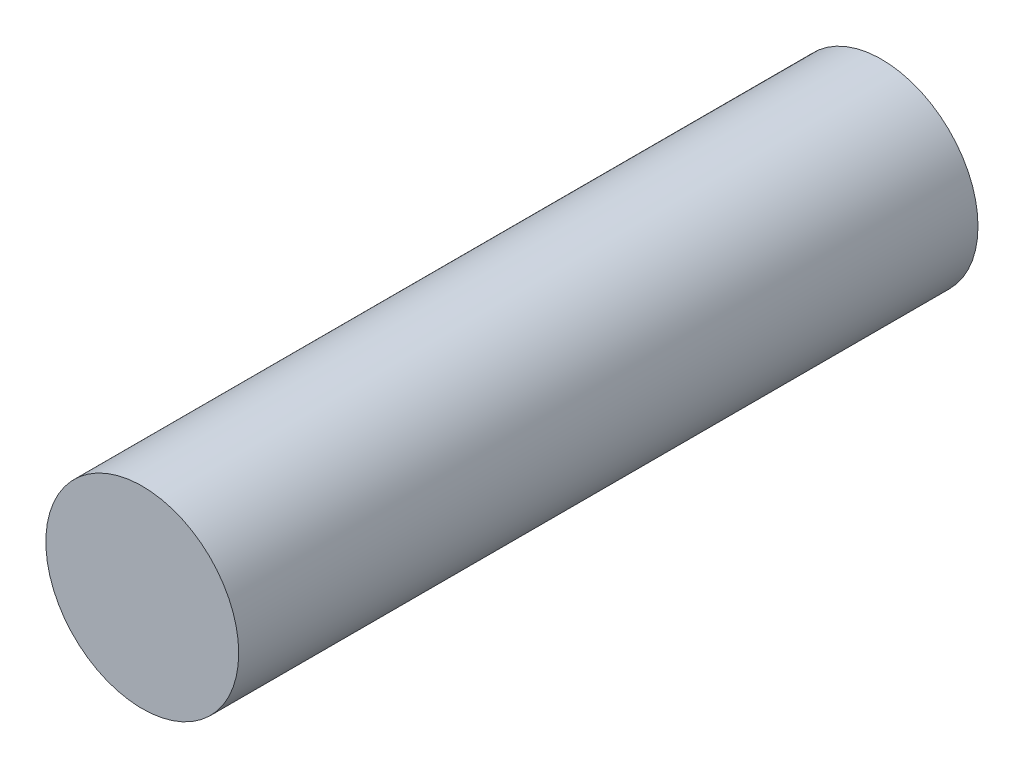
ISO-10303-21;
HEADER;
FILE_DESCRIPTION(('STEP AP214'),'2;1');
FILE_NAME('part.step','',(''),(''),'','','');
FILE_SCHEMA(('AUTOMOTIVE_DESIGN { 1 0 10303 214 1 1 1 1 }'));
ENDSEC;
DATA;
#1=APPLICATION_CONTEXT('core data for automotive mechanical design processes');
#2=APPLICATION_PROTOCOL_DEFINITION('international standard','automotive_design',2000,#1);
#3=PRODUCT_CONTEXT('',#1,'mechanical');
#4=PRODUCT('Part','Part','',(#3));
#5=PRODUCT_RELATED_PRODUCT_CATEGORY('part','',(#4));
#6=PRODUCT_DEFINITION_FORMATION('','',#4);
#7=PRODUCT_DEFINITION_CONTEXT('part definition',#1,'design');
#8=PRODUCT_DEFINITION('design','',#6,#7);
#9=PRODUCT_DEFINITION_SHAPE('','',#8);
#10=(LENGTH_UNIT() NAMED_UNIT(*) SI_UNIT(.MILLI.,.METRE.));
#11=(NAMED_UNIT(*) PLANE_ANGLE_UNIT() SI_UNIT($,.RADIAN.));
#12=(NAMED_UNIT(*) SI_UNIT($,.STERADIAN.) SOLID_ANGLE_UNIT());
#13=UNCERTAINTY_MEASURE_WITH_UNIT(LENGTH_MEASURE(1.E-05),#10,'distance_accuracy_value','');
#14=(GEOMETRIC_REPRESENTATION_CONTEXT(3) GLOBAL_UNCERTAINTY_ASSIGNED_CONTEXT((#13)) GLOBAL_UNIT_ASSIGNED_CONTEXT((#10,
#11,#12)) REPRESENTATION_CONTEXT('',''));
#15=CARTESIAN_POINT('',(0.,0.,0.));
#16=DIRECTION('',(0.,0.,1.));
#17=DIRECTION('',(1.,0.,0.));
#18=AXIS2_PLACEMENT_3D('',#15,#16,#17);
#19=CARTESIAN_POINT('',(0.,0.,115.));
#20=DIRECTION('',(0.,0.,-1.));
#21=DIRECTION('',(-1.,0.,0.));
#22=AXIS2_PLACEMENT_3D('',#19,#20,#21);
#23=CYLINDRICAL_SURFACE('',#22,15.);
#24=CARTESIAN_POINT('',(0.,0.,115.));
#25=DIRECTION('',(0.,0.,1.));
#26=DIRECTION('',(1.,0.,0.));
#27=AXIS2_PLACEMENT_3D('',#24,#25,#26);
#28=CIRCLE('',#27,15.);
#29=CARTESIAN_POINT('',(15.,0.,115.));
#30=VERTEX_POINT('',#29);
#31=EDGE_CURVE('E11',#30,#30,#28,.T.);
#32=ORIENTED_EDGE('',*,*,#31,.F.);
#33=EDGE_LOOP('',(#32));
#34=FACE_BOUND('',#33,.T.);
#35=CARTESIAN_POINT('',(0.,0.,0.));
#36=DIRECTION('',(0.,0.,1.));
#37=DIRECTION('',(1.,0.,0.));
#38=AXIS2_PLACEMENT_3D('',#35,#36,#37);
#39=CIRCLE('',#38,15.);
#40=CARTESIAN_POINT('',(15.,0.,0.));
#41=VERTEX_POINT('',#40);
#42=EDGE_CURVE('E46',#41,#41,#39,.T.);
#43=ORIENTED_EDGE('',*,*,#42,.T.);
#44=EDGE_LOOP('',(#43));
#45=FACE_BOUND('',#44,.T.);
#46=ADVANCED_FACE('F43',(#34,#45),#23,.T.);
#47=CARTESIAN_POINT('',(0.,0.,115.));
#48=DIRECTION('',(0.,0.,1.));
#49=DIRECTION('',(1.,0.,0.));
#50=AXIS2_PLACEMENT_3D('',#47,#48,#49);
#51=PLANE('',#50);
#52=ORIENTED_EDGE('',*,*,#31,.T.);
#53=EDGE_LOOP('',(#52));
#54=FACE_BOUND('',#53,.T.);
#55=ADVANCED_FACE('F72',(#54),#51,.T.);
#56=CARTESIAN_POINT('',(0.,0.,0.));
#57=DIRECTION('',(0.,0.,1.));
#58=DIRECTION('',(1.,0.,0.));
#59=AXIS2_PLACEMENT_3D('',#56,#57,#58);
#60=PLANE('',#59);
#61=CARTESIAN_POINT('',(0.,0.,0.));
#62=DIRECTION('',(0.,0.,-1.));
#63=DIRECTION('',(-1.,0.,0.));
#64=AXIS2_PLACEMENT_3D('',#61,#62,#63);
#65=CIRCLE('',#64,14.5);
#66=CARTESIAN_POINT('',(-14.5,0.,0.));
#67=VERTEX_POINT('',#66);
#68=EDGE_CURVE('E62',#67,#67,#65,.T.);
#69=ORIENTED_EDGE('',*,*,#68,.F.);
#70=EDGE_LOOP('',(#69));
#71=FACE_BOUND('',#70,.T.);
#72=ORIENTED_EDGE('',*,*,#42,.F.);
#73=EDGE_LOOP('',(#72));
#74=FACE_BOUND('',#73,.T.);
#75=ADVANCED_FACE('F56',(#71,#74),#60,.F.);
#76=CARTESIAN_POINT('',(0.,0.,105.8));
#77=DIRECTION('',(0.,0.,-1.));
#78=DIRECTION('',(-1.,0.,0.));
#79=AXIS2_PLACEMENT_3D('',#76,#77,#78);
#80=CONICAL_SURFACE('',#79,14.5,1.02974425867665);
#81=CARTESIAN_POINT('',(0.,0.,114.5124789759));
#82=VERTEX_POINT('',#81);
#83=VERTEX_LOOP('',#82);
#84=FACE_BOUND('',#83,.T.);
#85=CARTESIAN_POINT('',(0.,0.,105.8));
#86=DIRECTION('',(0.,0.,-1.));
#87=DIRECTION('',(-1.,0.,0.));
#88=AXIS2_PLACEMENT_3D('',#85,#86,#87);
#89=CIRCLE('',#88,14.5);
#90=CARTESIAN_POINT('',(-14.5,0.,105.8));
#91=VERTEX_POINT('',#90);
#92=EDGE_CURVE('E60',#91,#91,#89,.T.);
#93=ORIENTED_EDGE('',*,*,#92,.T.);
#94=EDGE_LOOP('',(#93));
#95=FACE_BOUND('',#94,.T.);
#96=ADVANCED_FACE('F52',(#84,#95),#80,.F.);
#97=CARTESIAN_POINT('',(0.,0.,0.));
#98=DIRECTION('',(0.,0.,-1.));
#99=DIRECTION('',(-1.,0.,0.));
#100=AXIS2_PLACEMENT_3D('',#97,#98,#99);
#101=CYLINDRICAL_SURFACE('',#100,14.5);
#102=ORIENTED_EDGE('',*,*,#92,.F.);
#103=EDGE_LOOP('',(#102));
#104=FACE_BOUND('',#103,.T.);
#105=ORIENTED_EDGE('',*,*,#68,.T.);
#106=EDGE_LOOP('',(#105));
#107=FACE_BOUND('',#106,.T.);
#108=ADVANCED_FACE('F55',(#104,#107),#101,.F.);
#109=CLOSED_SHELL('',(#46,#55,#75,#96,#108));
#110=MANIFOLD_SOLID_BREP('B2',#109);
#111=ADVANCED_BREP_SHAPE_REPRESENTATION('',(#18,#110),#14);
#112=SHAPE_DEFINITION_REPRESENTATION(#9,#111);
ENDSEC;
END-ISO-10303-21;
